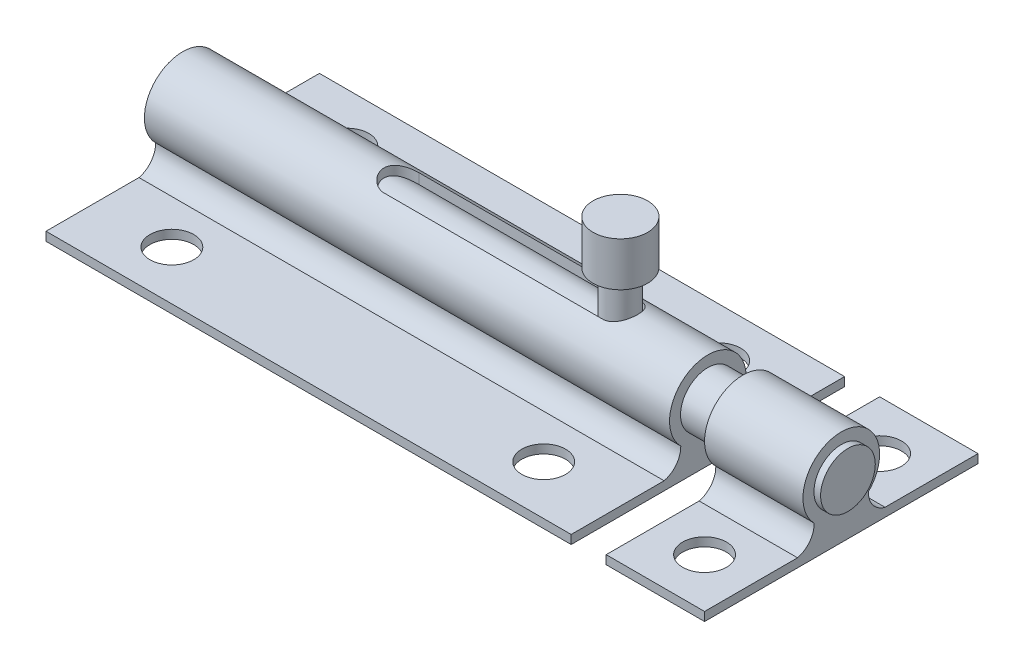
from build123d import *

# Parameters (mm, degrees)
SKETCH1_W               = 76.2
SKETCH1_H               = 39.6748
BOSS_EXTRUDE1_DEPTH     = 1.27
BOSS_EXTRUDE2_DEPTH     = 38.1
SKETCH3_R               = 3.96875
BOSS_EXTRUDE3_DEPTH     = 20.32
BOSS_EXTRUDE4_START     = 19.3548
BOSS_EXTRUDE4_DEPTH     = 14.2748
SKETCH5_R               = 2.286
BOSS_EXTRUDE5_DEPTH     = 24.9428
SKETCH6_R               = 3.9624
BOSS_EXTRUDE6_DEPTH     = 6.4008
SKETCH7_R               = 3.175
CUT_EXTRUDE1_DEPTH      = 67.081921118
SKETCH8_R               = 3.96875
CUT_EXTRUDE2_DEPTH      = 19.05
CUT_EXTRUDE4_REACH      = 83.322
CUT_EXTRUDE4_END_RADIUS = 4.2926
CUT_EXTRUDE4_START      = 15.24
SKETCH9_R               = 2.286


with BuildPart() as part:
    # Sketch1 → Boss-Extrude1 (new body)
    with BuildSketch(Plane(origin=(0, 0, 0), x_dir=(1, 0, 0), z_dir=(0, 1, 0))):
        Rectangle(SKETCH1_W, SKETCH1_H)
    extrude(amount=BOSS_EXTRUDE1_DEPTH)

    # Sketch2 → Boss-Extrude2 (add, symmetric)
    with BuildSketch(Plane(origin=(0, 0, 0), x_dir=(0, 0, -1), z_dir=(1, 0, 0))):
        with BuildLine():
            Line((-6.35, 1.27), (6.35, 1.27))
            ThreePointArc((6.35, 1.27), (4.58755628, 2.421946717), (3.933352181, 4.423247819))
            ThreePointArc((3.933352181, 4.423247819), (0, 13.9192), (-3.933352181, 4.423247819))
            ThreePointArc((-3.933352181, 4.423247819), (-4.58755628, 2.421946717), (-6.35, 1.27))
        make_face()
    extrude(amount=BOSS_EXTRUDE2_DEPTH, both=True)

    # Sketch3 → Boss-Extrude3 (add)
    with BuildSketch(Plane(origin=(38.1, 0, 0), x_dir=(0, 0, -1), z_dir=(1, 0, 0))):
        with Locations(Location((0, 8.3566, 0), (0, 0, 180))):
            Circle(SKETCH3_R)
    extrude(amount=BOSS_EXTRUDE3_DEPTH)

    # Sketch4 → Boss-Extrude4 (add)
    with BuildSketch(Plane(origin=(38.1, 0, 0), x_dir=(0, 0, -1), z_dir=(1, 0, 0)).offset(BOSS_EXTRUDE4_START)):
        with BuildLine():
            Line((-19.8374, 0), (19.8374, 0))
            Line((19.8374, 0), (19.8374, 1.27))
            Line((19.8374, 1.27), (6.35, 1.27))
            ThreePointArc((6.35, 1.27), (4.58755628, 2.421946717), (3.933352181, 4.423247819))
            ThreePointArc((3.933352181, 4.423247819), (0, 13.9192), (-3.933352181, 4.423247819))
            ThreePointArc((-3.933352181, 4.423247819), (-4.58755628, 2.421946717), (-6.35, 1.27))
            Line((-6.35, 1.27), (-19.8374, 1.27))
            Line((-19.8374, 1.27), (-19.8374, 0))
        make_face()
    extrude(amount=-BOSS_EXTRUDE4_DEPTH)

    # Sketch5 → Boss-Extrude5 (add)
    with BuildSketch(Plane(origin=(0, 0, 0), x_dir=(1, 0, 0), z_dir=(0, 1, 0))):
        with Locations(Location((25.4, 0, 0), (0, 0, 90))):
            Circle(SKETCH5_R)
    extrude(amount=BOSS_EXTRUDE5_DEPTH)

    # Sketch6 → Boss-Extrude6 (add)
    with BuildSketch(Plane(origin=(0, 24.9428, 0), x_dir=(1, 0, 0), z_dir=(0, 1, 0))):
        with Locations(Location((25.4, 0, 0), (0, 0, 270))):
            Circle(SKETCH6_R)
    extrude(amount=-BOSS_EXTRUDE6_DEPTH)

    # Sketch7 → Cut-Extrude1 (cut, through all)
    with BuildSketch(Plane(origin=(0, 1.27, 0), x_dir=(1, 0, 0), z_dir=(0, 1, 0))):
        with Locations(Location((-26.9748, 12.7, 0), (0, 0, 270))):
            Circle(SKETCH7_R)
        with Locations(Location((26.9748, 12.7, 0), (0, 0, 270))):
            Circle(SKETCH7_R)
        with Locations(Location((50.3174, 12.7, 0), (0, 0, 270))):
            Circle(SKETCH7_R)
        with Locations(Location((50.3174, -12.7, 0), (0, 0, 270))):
            Circle(SKETCH7_R)
        with Locations(Location((26.9748, -12.7, 0), (0, 0, 270))):
            Circle(SKETCH7_R)
        with Locations(Location((-26.9748, -12.7, 0), (0, 0, 270))):
            Circle(SKETCH7_R)
    extrude(amount=-CUT_EXTRUDE1_DEPTH, mode=Mode.SUBTRACT)

    # Sketch8 → Cut-Extrude2 (cut)
    with BuildSketch(Plane.ZY.offset(38.1)):
        with Locations((0, 8.3566)):
            Circle(SKETCH8_R)
    extrude(amount=-CUT_EXTRUDE2_DEPTH, mode=Mode.SUBTRACT)

    # Cut-Extrude4: up to this cylinder (the profile starts outside it)
    cut_extrude4_end = Plane(origin=(7.946803, 8.3566, 0), z_dir=(-1, 0, 0)) * Cylinder(CUT_EXTRUDE4_END_RADIUS, 176.2292, mode=Mode.PRIVATE)
    # Sketch9 → Cut-Extrude4 (cut, up to the surface)
    with BuildSketch(Plane(origin=(0, 1.27, 0), x_dir=(1, 0, 0), z_dir=(0, 1, 0)).offset(CUT_EXTRUDE4_START), mode=Mode.PRIVATE) as cut_extrude4_sk1:
        with BuildLine():
            Line((-6.35, 2.54), (25.4, 2.54))
            ThreePointArc((25.4, 2.54), (27.94, 0), (25.4, -2.54))
            Line((25.4, -2.54), (-6.35, -2.54))
            ThreePointArc((-6.35, -2.54), (-8.89, 0), (-6.35, 2.54))
        make_face()
        with Locations(Location((25.4, 0, 0), (0, 0, 270))):
            Circle(SKETCH9_R, mode=Mode.SUBTRACT)
    cut_extrude4_tool1 = extrude(cut_extrude4_sk1.sketch, amount=-CUT_EXTRUDE4_REACH, mode=Mode.PRIVATE) - cut_extrude4_end
    add(cut_extrude4_tool1.solids().sort_by_distance((7.946803, 16.51, 0))[0], mode=Mode.SUBTRACT)


solid = part.part
